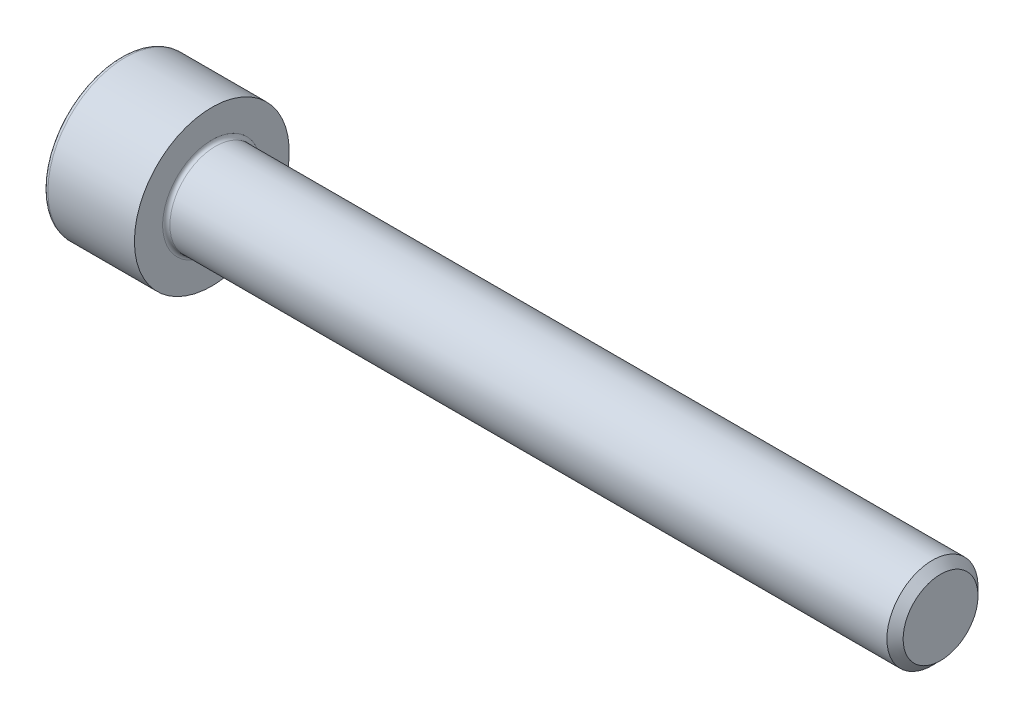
from build123d import *

# Parameters (mm, degrees)
FILLET1_R   = 0.2
FILLET2_R   = 0.25
HEX_2_DEPTH = 2.5


with BuildPart() as part:
    # BodySke → Base-Revolve (revolve)
    with BuildSketch(Plane.XY, mode=Mode.PRIVATE) as base_revolve_sk:
        Polygon((0, 0), (0, 4.25), (5, 4.25), (5, 2.5), (44.555, 2.5), (45, 2.055), (45, 0), align=None)
    revolve(base_revolve_sk.sketch.rotate(Axis((-31.75, 0, 0), (1, 0, 0)), 90), axis=Axis((-31.75, 0, 0), (1, 0, 0)))

    # Fillet1
    fillet1_edges = [part.edges().sort_by_distance(p)[0] for p in [
        (5, 0, -2.5),
    ]]
    fillet(fillet1_edges, radius=FILLET1_R)

    # Fillet2
    fillet2_edges = [part.edges().sort_by_distance(p)[0] for p in [
        (0, 0, -4.25),
    ]]
    fillet(fillet2_edges, radius=FILLET2_R)

    # Sketch2 → Hex-PreBroach (revolve, cut)
    with BuildSketch(Plane.XY, mode=Mode.PRIVATE) as hex_prebroach_sk:
        Polygon((0, 2.042), (2.5, 2.042), (3.67894925, 0), (0, 0), align=None)
    revolve(hex_prebroach_sk.sketch.rotate(Axis((0, 0, 0), (1, 0, 0)), 90), axis=Axis((0, 0, 0), (1, 0, 0)), mode=Mode.SUBTRACT)

    # Sketch3 → Hex 2 (cut)
    with BuildSketch(Plane(origin=(0, 0, 0), x_dir=(0, 0.500000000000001, 0.866025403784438), z_dir=(-1, 0, 0))):
        Polygon((1.17894925, 2.042), (-1.17894925, 2.042), (-2.357898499, 0), (-1.17894925, -2.042), (1.17894925, -2.042), (2.357898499, 0), align=None)
    extrude(amount=-HEX_2_DEPTH, mode=Mode.SUBTRACT)


solid = part.part
